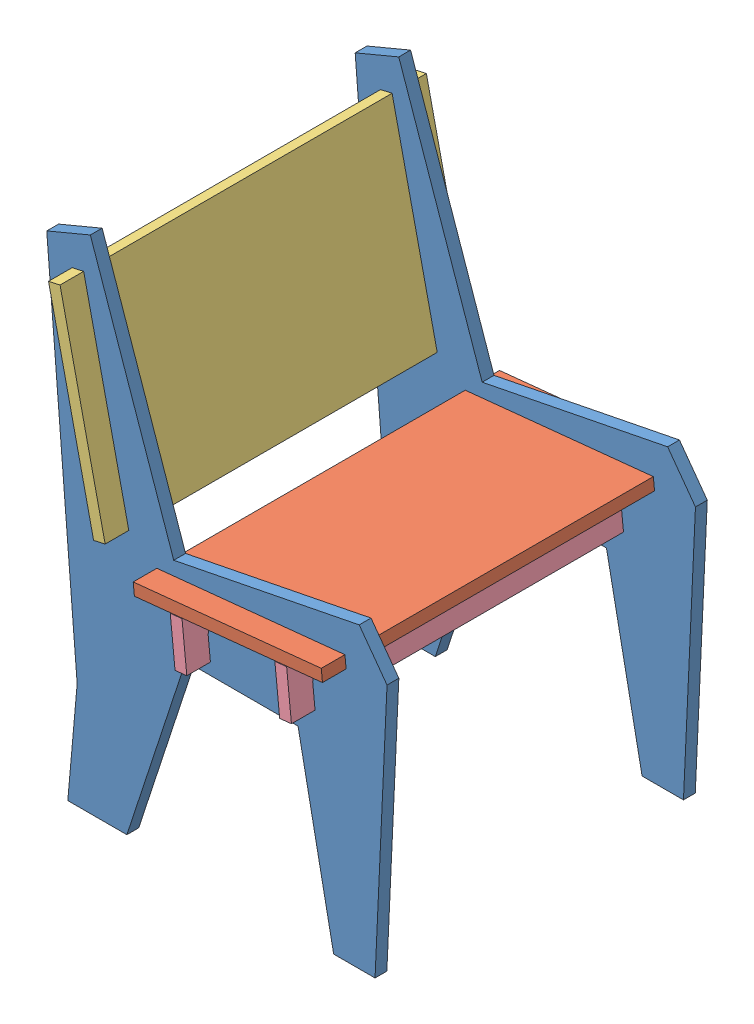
SolidWorks assembly Chaise.SLDASM, configuration Défaut (file format 5000). Lengths in mm.
Overall size (575.94 848.12 624).
6 component instances, 4 part files, 15 mates.
Components (placement in the parent):
- Flanc chaise-1: Flanc chaise.SLDPRT [Défaut] at origin size (575.94 848.12 20)
- Flanc chaise-2: Flanc chaise.SLDPRT [Défaut] at (0 0 -522) size (575.94 848.12 20)
- Assise chaise-2: Assise chaise.SLDPRT [Défaut] at (311.8818 412.2601 -250) x (0.994811 0.101741 0) z (0 0 1) size (320 20 620)
- Dossier chaise-1: Dossier chaise.SLDPRT [Défaut] at (55.2975 616.2224 -250) x (0 0 1) z (-0.975904 -0.218199 0) size (620 350 20)
- traverse chaise-1: traverse chaise.SLDPRT [Défaut] at (409.554 341.8319 61) x (0 0 -1) z (0.994811 0.101741 0) size (624 80 20)
- traverse chaise-2: traverse chaise.SLDPRT [Défaut] at (232.4777 323.722 61) x (0 0 -1) z (0.994811 0.101741 0) size (624 80 20)
Mates (geometry in assembly coordinates):
- Coïncidente1: coincident aligned: plane of Flanc chaise-1 through (0 0 20) normal (0 -1 0); plane of Flanc chaise-2 through (0 0 -502) normal (0 -1 0)
- Coïncidente2: coincident aligned: plane of Flanc chaise-1 through (15.8848 179.2977 20) normal (-0.996098 0.088249 0); plane of Flanc chaise-2 through (15.8848 179.2977 -502) normal (-0.996098 0.088249 0)
- Distance2: distance = 40 mm aligned: plane of Flanc chaise-1 through (0 0 20) normal (0 0 1); plane of Assise chaise-2 through (469.0167 448.4349 60) normal (0 0 1)
- Distance1: distance = 542 mm anti-aligned: plane of Flanc chaise-2 through (0 0 -522) normal (0 0 -1); plane of Flanc chaise-1 through (0 0 20) normal (0 0 1)
- Coïncidente10: coincident anti-aligned: plane of Flanc chaise-1 through (150.6772 415.8778 20) normal (0.101741 -0.994811 0); plane of Assise chaise-2 through (309.8469 432.1563 -250) normal (-0.101741 0.994811 0)
- Coïncidente11: coincident anti-aligned: plane of Flanc chaise-1 through (150.6772 415.8778 20) normal (0.994811 0.101741 0); plane of Assise chaise-2 through (150.6772 415.8778 60) normal (-0.994811 -0.101741 0)
- Distance3: distance = 40 mm aligned: plane of Flanc chaise-1 through (0 0 20) normal (0 0 1); plane of Dossier chaise-1 through (83.7233 443.2571 60) normal (0 0 1)
- Coïncidente14: coincident anti-aligned: plane of Flanc chaise-2 through (26.8716 789.1876 -502) normal (-0.975904 -0.218199 0); plane of Dossier chaise-1 through (65.0565 618.4044 -250) normal (0.975904 0.218199 0)
- Coïncidente15: coincident anti-aligned: plane of Flanc chaise-2 through (26.8716 789.1876 -502) normal (0.218199 -0.975904 0); plane of Dossier chaise-1 through (7.3535 784.8236 -560) normal (-0.218199 0.975904 0)
- Coïncidente16: coincident anti-aligned: plane of Flanc chaise-1 through (411.3629 422.4342 -0.001) normal (-0.994811 -0.101741 0); plane of traverse chaise-1 through (419.5021 342.8493 61) normal (0.994811 0.101741 0)
- Coïncidente17: coincident anti-aligned: plane of Flanc chaise-1 through (393.5467 380.4035 -0.001) normal (-0.101741 0.994811 0); plane of traverse chaise-1 through (415.4335 382.6419 21) normal (0.101741 -0.994811 0)
- Largeur1: width anti-aligned: plane of traverse chaise-1 through (419.5031 342.8494 -1) normal (0 0 1); plane of traverse chaise-1 through (419.5031 342.8494 21) normal (0 0 -1); plane of Flanc chaise-1 through (0 0 0) normal (0 0 -1); plane of Flanc chaise-1 through (0 0 20) normal (0 0 1)
- Coïncidente18: coincident anti-aligned: plane of Flanc chaise-1 through (234.2865 404.3243 -0.001) normal (-0.994811 -0.101741 0); plane of traverse chaise-2 through (242.4258 324.7394 61) normal (0.994811 0.101741 0)
- Coïncidente19: coincident anti-aligned: plane of Flanc chaise-1 through (216.4703 362.2936 -0.001) normal (-0.101741 0.994811 0); plane of traverse chaise-2 through (238.3572 364.532 21) normal (0.101741 -0.994811 0)
- Largeur2: width aligned: plane of traverse chaise-2 through (242.4268 324.7395 -1) normal (0 0 1); plane of traverse chaise-2 through (242.4268 324.7395 21) normal (0 0 -1); plane of Flanc chaise-1 through (0 0 20) normal (0 0 1); plane of Flanc chaise-1 through (0 0 0) normal (0 0 -1)
